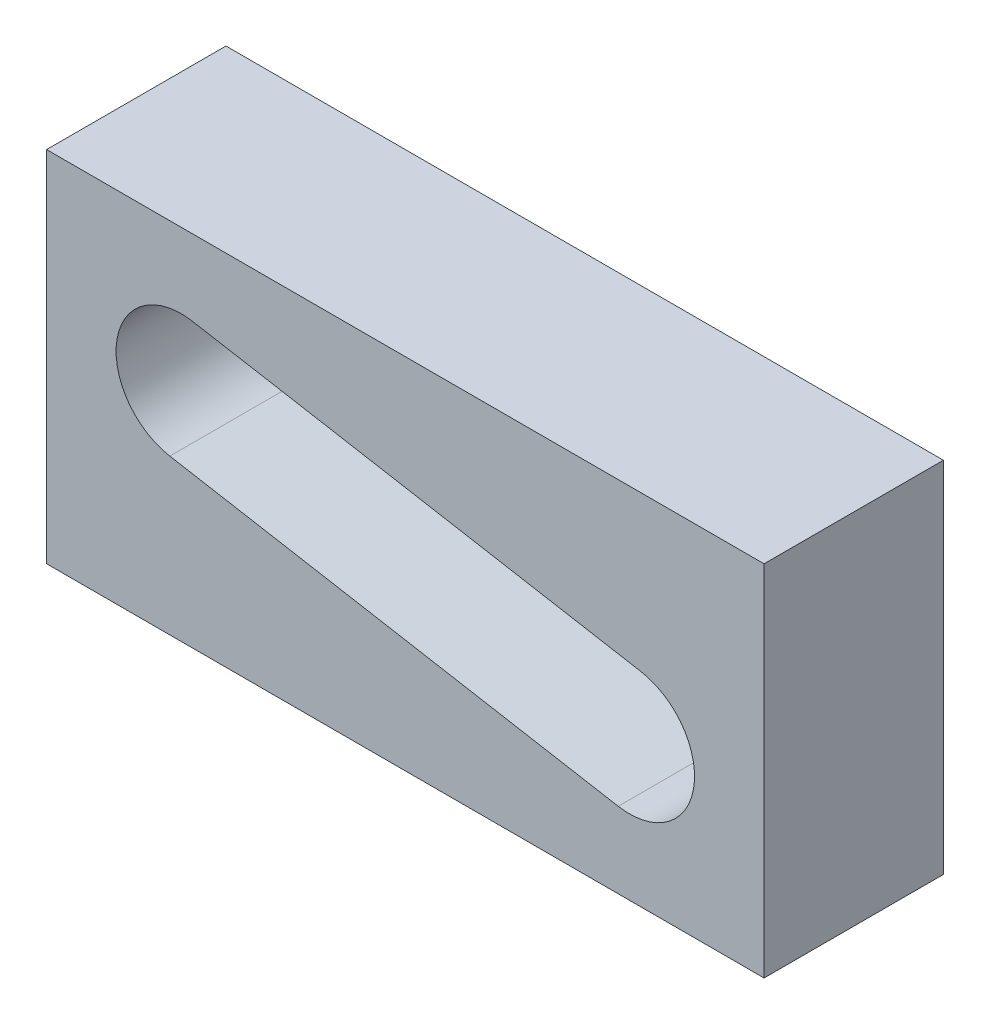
ISO-10303-21;
HEADER;
FILE_DESCRIPTION(('STEP AP214'),'2;1');
FILE_NAME('part.step','',(''),(''),'','','');
FILE_SCHEMA(('AUTOMOTIVE_DESIGN { 1 0 10303 214 1 1 1 1 }'));
ENDSEC;
DATA;
#1=APPLICATION_CONTEXT('core data for automotive mechanical design processes');
#2=APPLICATION_PROTOCOL_DEFINITION('international standard','automotive_design',2000,#1);
#3=PRODUCT_CONTEXT('',#1,'mechanical');
#4=PRODUCT('Part','Part','',(#3));
#5=PRODUCT_RELATED_PRODUCT_CATEGORY('part','',(#4));
#6=PRODUCT_DEFINITION_FORMATION('','',#4);
#7=PRODUCT_DEFINITION_CONTEXT('part definition',#1,'design');
#8=PRODUCT_DEFINITION('design','',#6,#7);
#9=PRODUCT_DEFINITION_SHAPE('','',#8);
#10=(LENGTH_UNIT() NAMED_UNIT(*) SI_UNIT(.MILLI.,.METRE.));
#11=(NAMED_UNIT(*) PLANE_ANGLE_UNIT() SI_UNIT($,.RADIAN.));
#12=(NAMED_UNIT(*) SI_UNIT($,.STERADIAN.) SOLID_ANGLE_UNIT());
#13=UNCERTAINTY_MEASURE_WITH_UNIT(LENGTH_MEASURE(1.E-05),#10,'distance_accuracy_value','');
#14=(GEOMETRIC_REPRESENTATION_CONTEXT(3) GLOBAL_UNCERTAINTY_ASSIGNED_CONTEXT((#13)) GLOBAL_UNIT_ASSIGNED_CONTEXT((#10,
#11,#12)) REPRESENTATION_CONTEXT('',''));
#15=CARTESIAN_POINT('',(0.,0.,0.));
#16=DIRECTION('',(0.,0.,1.));
#17=DIRECTION('',(1.,0.,0.));
#18=AXIS2_PLACEMENT_3D('',#15,#16,#17);
#19=CARTESIAN_POINT('',(0.,0.,2.));
#20=DIRECTION('',(0.,0.,-1.));
#21=DIRECTION('',(-1.,0.,0.));
#22=AXIS2_PLACEMENT_3D('',#19,#20,#21);
#23=PLANE('',#22);
#24=DIRECTION('',(0.,1.,0.));
#25=VECTOR('',#24,1.);
#26=CARTESIAN_POINT('',(0.,0.,2.));
#27=LINE('',#26,#25);
#28=CARTESIAN_POINT('',(0.,0.,2.));
#29=VERTEX_POINT('',#28);
#30=CARTESIAN_POINT('',(0.,4.,2.));
#31=VERTEX_POINT('',#30);
#32=EDGE_CURVE('E158',#29,#31,#27,.T.);
#33=ORIENTED_EDGE('',*,*,#32,.F.);
#34=DIRECTION('',(1.,0.,0.));
#35=VECTOR('',#34,1.);
#36=CARTESIAN_POINT('',(0.,0.,2.));
#37=LINE('',#36,#35);
#38=CARTESIAN_POINT('',(8.,0.,2.));
#39=VERTEX_POINT('',#38);
#40=EDGE_CURVE('E167',#29,#39,#37,.T.);
#41=ORIENTED_EDGE('',*,*,#40,.T.);
#42=DIRECTION('',(0.,1.,0.));
#43=VECTOR('',#42,1.);
#44=CARTESIAN_POINT('',(8.,0.,2.));
#45=LINE('',#44,#43);
#46=CARTESIAN_POINT('',(8.,4.,2.));
#47=VERTEX_POINT('',#46);
#48=EDGE_CURVE('E165',#39,#47,#45,.T.);
#49=ORIENTED_EDGE('',*,*,#48,.T.);
#50=DIRECTION('',(1.,0.,0.));
#51=VECTOR('',#50,1.);
#52=CARTESIAN_POINT('',(0.,4.,2.));
#53=LINE('',#52,#51);
#54=EDGE_CURVE('E161',#31,#47,#53,.T.);
#55=ORIENTED_EDGE('',*,*,#54,.F.);
#56=EDGE_LOOP('',(#33,#41,#49,#55));
#57=FACE_BOUND('',#56,.T.);
#58=DIRECTION('',(0.984807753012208,-0.173648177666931,0.));
#59=VECTOR('',#58,1.);
#60=CARTESIAN_POINT('',(0.336739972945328,1.9097472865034,2.));
#61=LINE('',#60,#59);
#62=CARTESIAN_POINT('',(1.37410507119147,1.72683183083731,2.));
#63=VERTEX_POINT('',#62);
#64=CARTESIAN_POINT('',(6.37410507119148,0.845196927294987,2.));
#65=VERTEX_POINT('',#64);
#66=EDGE_CURVE('E124',#63,#65,#61,.T.);
#67=ORIENTED_EDGE('',*,*,#66,.F.);
#68=CARTESIAN_POINT('',(1.5,2.44081745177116,2.));
#69=DIRECTION('',(0.,0.,1.));
#70=DIRECTION('',(1.,0.,0.));
#71=AXIS2_PLACEMENT_3D('',#68,#69,#70);
#72=CIRCLE('',#71,0.725);
#73=CARTESIAN_POINT('',(1.62589492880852,3.15480307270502,2.));
#74=VERTEX_POINT('',#73);
#75=EDGE_CURVE('E143',#74,#63,#72,.T.);
#76=ORIENTED_EDGE('',*,*,#75,.F.);
#77=DIRECTION('',(0.984807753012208,-0.173648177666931,0.));
#78=VECTOR('',#77,1.);
#79=CARTESIAN_POINT('',(0.588529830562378,3.3377185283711,2.));
#80=LINE('',#79,#78);
#81=CARTESIAN_POINT('',(6.62589492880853,2.27316816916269,2.));
#82=VERTEX_POINT('',#81);
#83=EDGE_CURVE('E74',#74,#82,#80,.T.);
#84=ORIENTED_EDGE('',*,*,#83,.T.);
#85=CARTESIAN_POINT('',(6.5,1.55918254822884,2.));
#86=DIRECTION('',(0.,0.,1.));
#87=DIRECTION('',(1.,0.,0.));
#88=AXIS2_PLACEMENT_3D('',#85,#86,#87);
#89=CIRCLE('',#88,0.725);
#90=EDGE_CURVE('E132',#65,#82,#89,.T.);
#91=ORIENTED_EDGE('',*,*,#90,.F.);
#92=EDGE_LOOP('',(#67,#76,#84,#91));
#93=FACE_BOUND('',#92,.T.);
#94=ADVANCED_FACE('F57',(#57,#93),#23,.F.);
#95=CARTESIAN_POINT('',(0.,0.,0.));
#96=DIRECTION('',(0.,0.,-1.));
#97=DIRECTION('',(-1.,0.,0.));
#98=AXIS2_PLACEMENT_3D('',#95,#96,#97);
#99=PLANE('',#98);
#100=DIRECTION('',(0.,1.,0.));
#101=VECTOR('',#100,1.);
#102=CARTESIAN_POINT('',(0.,0.,0.));
#103=LINE('',#102,#101);
#104=CARTESIAN_POINT('',(0.,0.,0.));
#105=VERTEX_POINT('',#104);
#106=CARTESIAN_POINT('',(0.,4.,0.));
#107=VERTEX_POINT('',#106);
#108=EDGE_CURVE('E139',#105,#107,#103,.T.);
#109=ORIENTED_EDGE('',*,*,#108,.T.);
#110=DIRECTION('',(1.,0.,0.));
#111=VECTOR('',#110,1.);
#112=CARTESIAN_POINT('',(0.,4.,0.));
#113=LINE('',#112,#111);
#114=CARTESIAN_POINT('',(8.,4.,0.));
#115=VERTEX_POINT('',#114);
#116=EDGE_CURVE('E171',#107,#115,#113,.T.);
#117=ORIENTED_EDGE('',*,*,#116,.T.);
#118=DIRECTION('',(0.,1.,0.));
#119=VECTOR('',#118,1.);
#120=CARTESIAN_POINT('',(8.,0.,0.));
#121=LINE('',#120,#119);
#122=CARTESIAN_POINT('',(8.,0.,0.));
#123=VERTEX_POINT('',#122);
#124=EDGE_CURVE('E174',#123,#115,#121,.T.);
#125=ORIENTED_EDGE('',*,*,#124,.F.);
#126=DIRECTION('',(1.,0.,0.));
#127=VECTOR('',#126,1.);
#128=CARTESIAN_POINT('',(0.,0.,0.));
#129=LINE('',#128,#127);
#130=EDGE_CURVE('E162',#105,#123,#129,.T.);
#131=ORIENTED_EDGE('',*,*,#130,.F.);
#132=EDGE_LOOP('',(#109,#117,#125,#131));
#133=FACE_BOUND('',#132,.T.);
#134=CARTESIAN_POINT('',(1.5,2.44081745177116,0.));
#135=DIRECTION('',(0.,0.,1.));
#136=DIRECTION('',(1.,0.,0.));
#137=AXIS2_PLACEMENT_3D('',#134,#135,#136);
#138=CIRCLE('',#137,0.725);
#139=CARTESIAN_POINT('',(1.62589492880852,3.15480307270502,0.));
#140=VERTEX_POINT('',#139);
#141=CARTESIAN_POINT('',(1.37410507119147,1.72683183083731,0.));
#142=VERTEX_POINT('',#141);
#143=EDGE_CURVE('E133',#140,#142,#138,.T.);
#144=ORIENTED_EDGE('',*,*,#143,.T.);
#145=DIRECTION('',(0.984807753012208,-0.173648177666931,0.));
#146=VECTOR('',#145,1.);
#147=CARTESIAN_POINT('',(0.336739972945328,1.9097472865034,0.));
#148=LINE('',#147,#146);
#149=CARTESIAN_POINT('',(6.37410507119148,0.845196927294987,0.));
#150=VERTEX_POINT('',#149);
#151=EDGE_CURVE('E82',#142,#150,#148,.T.);
#152=ORIENTED_EDGE('',*,*,#151,.T.);
#153=CARTESIAN_POINT('',(6.5,1.55918254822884,0.));
#154=DIRECTION('',(0.,0.,1.));
#155=DIRECTION('',(1.,0.,0.));
#156=AXIS2_PLACEMENT_3D('',#153,#154,#155);
#157=CIRCLE('',#156,0.725);
#158=CARTESIAN_POINT('',(6.62589492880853,2.27316816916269,0.));
#159=VERTEX_POINT('',#158);
#160=EDGE_CURVE('E138',#150,#159,#157,.T.);
#161=ORIENTED_EDGE('',*,*,#160,.T.);
#162=DIRECTION('',(0.984807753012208,-0.173648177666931,0.));
#163=VECTOR('',#162,1.);
#164=CARTESIAN_POINT('',(0.588529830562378,3.3377185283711,0.));
#165=LINE('',#164,#163);
#166=EDGE_CURVE('E149',#140,#159,#165,.T.);
#167=ORIENTED_EDGE('',*,*,#166,.F.);
#168=EDGE_LOOP('',(#144,#152,#161,#167));
#169=FACE_BOUND('',#168,.T.);
#170=ADVANCED_FACE('F191',(#133,#169),#99,.T.);
#171=CARTESIAN_POINT('',(0.,0.,2.));
#172=DIRECTION('',(-1.,0.,0.));
#173=DIRECTION('',(0.,0.,1.));
#174=AXIS2_PLACEMENT_3D('',#171,#172,#173);
#175=PLANE('',#174);
#176=ORIENTED_EDGE('',*,*,#108,.F.);
#177=DIRECTION('',(0.,0.,-1.));
#178=VECTOR('',#177,1.);
#179=CARTESIAN_POINT('',(0.,0.,2.));
#180=LINE('',#179,#178);
#181=EDGE_CURVE('E12',#29,#105,#180,.T.);
#182=ORIENTED_EDGE('',*,*,#181,.F.);
#183=ORIENTED_EDGE('',*,*,#32,.T.);
#184=DIRECTION('',(0.,0.,-1.));
#185=VECTOR('',#184,1.);
#186=CARTESIAN_POINT('',(0.,4.,2.));
#187=LINE('',#186,#185);
#188=EDGE_CURVE('E61',#31,#107,#187,.T.);
#189=ORIENTED_EDGE('',*,*,#188,.T.);
#190=EDGE_LOOP('',(#176,#182,#183,#189));
#191=FACE_BOUND('',#190,.T.);
#192=ADVANCED_FACE('F59',(#191),#175,.T.);
#193=CARTESIAN_POINT('',(0.,0.,2.));
#194=DIRECTION('',(0.,1.,0.));
#195=DIRECTION('',(0.,0.,1.));
#196=AXIS2_PLACEMENT_3D('',#193,#194,#195);
#197=PLANE('',#196);
#198=ORIENTED_EDGE('',*,*,#130,.T.);
#199=DIRECTION('',(0.,0.,-1.));
#200=VECTOR('',#199,1.);
#201=CARTESIAN_POINT('',(8.,0.,2.));
#202=LINE('',#201,#200);
#203=EDGE_CURVE('E66',#39,#123,#202,.T.);
#204=ORIENTED_EDGE('',*,*,#203,.F.);
#205=ORIENTED_EDGE('',*,*,#40,.F.);
#206=ORIENTED_EDGE('',*,*,#181,.T.);
#207=EDGE_LOOP('',(#198,#204,#205,#206));
#208=FACE_BOUND('',#207,.T.);
#209=ADVANCED_FACE('F195',(#208),#197,.F.);
#210=CARTESIAN_POINT('',(8.,0.,2.));
#211=DIRECTION('',(-1.,0.,0.));
#212=DIRECTION('',(0.,0.,1.));
#213=AXIS2_PLACEMENT_3D('',#210,#211,#212);
#214=PLANE('',#213);
#215=ORIENTED_EDGE('',*,*,#124,.T.);
#216=DIRECTION('',(0.,0.,-1.));
#217=VECTOR('',#216,1.);
#218=CARTESIAN_POINT('',(8.,4.,2.));
#219=LINE('',#218,#217);
#220=EDGE_CURVE('E179',#47,#115,#219,.T.);
#221=ORIENTED_EDGE('',*,*,#220,.F.);
#222=ORIENTED_EDGE('',*,*,#48,.F.);
#223=ORIENTED_EDGE('',*,*,#203,.T.);
#224=EDGE_LOOP('',(#215,#221,#222,#223));
#225=FACE_BOUND('',#224,.T.);
#226=ADVANCED_FACE('F199',(#225),#214,.F.);
#227=CARTESIAN_POINT('',(0.,4.,2.));
#228=DIRECTION('',(0.,1.,0.));
#229=DIRECTION('',(0.,0.,1.));
#230=AXIS2_PLACEMENT_3D('',#227,#228,#229);
#231=PLANE('',#230);
#232=ORIENTED_EDGE('',*,*,#116,.F.);
#233=ORIENTED_EDGE('',*,*,#188,.F.);
#234=ORIENTED_EDGE('',*,*,#54,.T.);
#235=ORIENTED_EDGE('',*,*,#220,.T.);
#236=EDGE_LOOP('',(#232,#233,#234,#235));
#237=FACE_BOUND('',#236,.T.);
#238=ADVANCED_FACE('F187',(#237),#231,.T.);
#239=CARTESIAN_POINT('',(0.336739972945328,1.9097472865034,2.));
#240=DIRECTION('',(0.173648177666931,0.984807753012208,0.));
#241=DIRECTION('',(-0.984807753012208,0.173648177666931,0.));
#242=AXIS2_PLACEMENT_3D('',#239,#240,#241);
#243=PLANE('',#242);
#244=ORIENTED_EDGE('',*,*,#151,.F.);
#245=DIRECTION('',(0.,0.,-1.));
#246=VECTOR('',#245,1.);
#247=CARTESIAN_POINT('',(1.37410507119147,1.72683183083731,2.));
#248=LINE('',#247,#246);
#249=EDGE_CURVE('E128',#63,#142,#248,.T.);
#250=ORIENTED_EDGE('',*,*,#249,.F.);
#251=ORIENTED_EDGE('',*,*,#66,.T.);
#252=DIRECTION('',(0.,0.,-1.));
#253=VECTOR('',#252,1.);
#254=CARTESIAN_POINT('',(6.37410507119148,0.845196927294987,2.));
#255=LINE('',#254,#253);
#256=EDGE_CURVE('E127',#65,#150,#255,.T.);
#257=ORIENTED_EDGE('',*,*,#256,.T.);
#258=EDGE_LOOP('',(#244,#250,#251,#257));
#259=FACE_BOUND('',#258,.T.);
#260=ADVANCED_FACE('F126',(#259),#243,.T.);
#261=CARTESIAN_POINT('',(6.5,1.55918254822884,2.));
#262=DIRECTION('',(0.,0.,-1.));
#263=DIRECTION('',(-1.,0.,0.));
#264=AXIS2_PLACEMENT_3D('',#261,#262,#263);
#265=CYLINDRICAL_SURFACE('',#264,0.725);
#266=ORIENTED_EDGE('',*,*,#160,.F.);
#267=ORIENTED_EDGE('',*,*,#256,.F.);
#268=ORIENTED_EDGE('',*,*,#90,.T.);
#269=DIRECTION('',(0.,0.,-1.));
#270=VECTOR('',#269,1.);
#271=CARTESIAN_POINT('',(6.62589492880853,2.27316816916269,2.));
#272=LINE('',#271,#270);
#273=EDGE_CURVE('E140',#82,#159,#272,.T.);
#274=ORIENTED_EDGE('',*,*,#273,.T.);
#275=EDGE_LOOP('',(#266,#267,#268,#274));
#276=FACE_BOUND('',#275,.T.);
#277=ADVANCED_FACE('F136',(#276),#265,.F.);
#278=CARTESIAN_POINT('',(0.588529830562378,3.3377185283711,2.));
#279=DIRECTION('',(0.173648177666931,0.984807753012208,0.));
#280=DIRECTION('',(-0.984807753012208,0.173648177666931,0.));
#281=AXIS2_PLACEMENT_3D('',#278,#279,#280);
#282=PLANE('',#281);
#283=ORIENTED_EDGE('',*,*,#166,.T.);
#284=ORIENTED_EDGE('',*,*,#273,.F.);
#285=ORIENTED_EDGE('',*,*,#83,.F.);
#286=DIRECTION('',(0.,0.,-1.));
#287=VECTOR('',#286,1.);
#288=CARTESIAN_POINT('',(1.62589492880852,3.15480307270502,2.));
#289=LINE('',#288,#287);
#290=EDGE_CURVE('E155',#74,#140,#289,.T.);
#291=ORIENTED_EDGE('',*,*,#290,.T.);
#292=EDGE_LOOP('',(#283,#284,#285,#291));
#293=FACE_BOUND('',#292,.T.);
#294=ADVANCED_FACE('F220',(#293),#282,.F.);
#295=CARTESIAN_POINT('',(1.5,2.44081745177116,2.));
#296=DIRECTION('',(0.,0.,-1.));
#297=DIRECTION('',(-1.,0.,0.));
#298=AXIS2_PLACEMENT_3D('',#295,#296,#297);
#299=CYLINDRICAL_SURFACE('',#298,0.725);
#300=ORIENTED_EDGE('',*,*,#143,.F.);
#301=ORIENTED_EDGE('',*,*,#290,.F.);
#302=ORIENTED_EDGE('',*,*,#75,.T.);
#303=ORIENTED_EDGE('',*,*,#249,.T.);
#304=EDGE_LOOP('',(#300,#301,#302,#303));
#305=FACE_BOUND('',#304,.T.);
#306=ADVANCED_FACE('F224',(#305),#299,.F.);
#307=CLOSED_SHELL('',(#94,#170,#192,#209,#226,#238,#260,#277,#294,#306));
#308=MANIFOLD_SOLID_BREP('B2',#307);
#309=ADVANCED_BREP_SHAPE_REPRESENTATION('',(#18,#308),#14);
#310=SHAPE_DEFINITION_REPRESENTATION(#9,#309);
ENDSEC;
END-ISO-10303-21;
